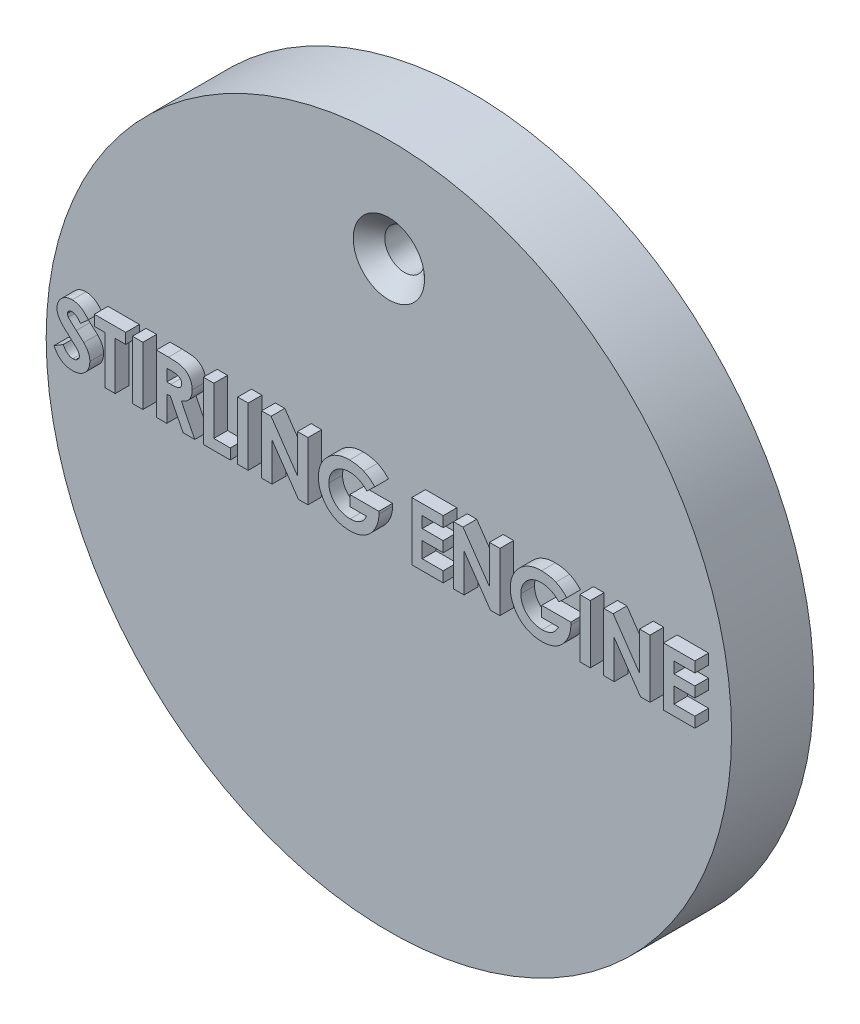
from build123d import *

# Parameters (mm, degrees)
SKETCH1_R                                       = 50
BOSS_EXTRUDE2_DEPTH                             = 12
SKETCH2_W                                       = 1.525641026
SKETCH2_H                                       = 8.5
SKETCH2_W_2                                     = 1.525641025
BOSS_EXTRUDE3_DEPTH                             = 2
CSK_FOR_M5_FLAT_HEAD_MACHINE_SCREW1_D           = 5.8
CSK_FOR_M5_FLAT_HEAD_MACHINE_SCREW1_CSINK_D     = 10.4
CSK_FOR_M5_FLAT_HEAD_MACHINE_SCREW1_CSINK_ANGLE = 90


with BuildPart() as part:
    # Sketch1 → Boss-Extrude2 (new body)
    with BuildSketch(Plane.XY):
        Circle(SKETCH1_R)
    extrude(amount=BOSS_EXTRUDE2_DEPTH)

    # Sketch2 → Boss-Extrude3 (add)
    # profile 1 of 14: a face of its own
    with BuildSketch(Plane.XY.offset(12)):
        with BuildLine():
            Line((-41.846153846, 7.364282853), (-42.986979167, 6.320512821))
            add(Edge.make_bspline(
                [(-42.986979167, 6.320512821), (-43.035847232, 6.389446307), (-43.129667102, 6.521788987), (-43.281739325, 6.698998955), (-43.433124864, 6.850172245), (-43.585226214, 6.974677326), (-43.739391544, 7.071757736), (-43.895353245, 7.140491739), (-44.052227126, 7.184186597), (-44.157622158, 7.189627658), (-44.209535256, 7.192307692)],
                knots=[0, 0, 0, 0, 1.299362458, 2.494594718, 3.587462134, 4.587049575, 5.512617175, 6.380583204, 7.202344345, 8, 8, 8, 8], degree=3))
            add(Edge.make_bspline(
                [(-44.209535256, 7.192307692), (-44.257958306, 7.190609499), (-44.351450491, 7.187330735), (-44.484730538, 7.154740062), (-44.603058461, 7.098493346), (-44.706318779, 7.024946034), (-44.788116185, 6.936338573), (-44.853425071, 6.84341213), (-44.890199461, 6.740842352), (-44.895039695, 6.670393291), (-44.897435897, 6.635516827)],
                knots=[0, 0, 0, 0, 1.185010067, 2.2879431, 3.333075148, 4.379039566, 5.372662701, 6.27520591, 7.14612461, 8, 8, 8, 8], degree=3))
            add(Edge.make_bspline(
                [(-44.897435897, 6.635516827), (-44.895934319, 6.600137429), (-44.892910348, 6.528888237), (-44.863702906, 6.424463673), (-44.81967895, 6.322428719), (-44.777612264, 6.260315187), (-44.756109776, 6.228565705)],
                knots=[0, 0, 0, 0, 0.967525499, 1.948461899, 2.951351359, 4, 4, 4, 4], degree=3))
            add(Edge.make_bspline(
                [(-44.756109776, 6.228565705), (-44.736561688, 6.203887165), (-44.691564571, 6.147080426), (-44.605764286, 6.057107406), (-44.498017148, 5.946882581), (-44.364176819, 5.82019626), (-44.209799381, 5.672492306), (-44.027729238, 5.50957702), (-43.823207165, 5.326405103), (-43.677837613, 5.198850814), (-43.60166266, 5.132011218)],
                knots=[0, 0, 0, 0, 0.473873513, 1.090794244, 1.870441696, 2.795289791, 3.865433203, 5.087734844, 6.473946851, 8, 8, 8, 8], degree=3))
            add(Edge.make_bspline(
                [(-43.60166266, 5.132011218), (-43.530161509, 5.070130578), (-43.394467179, 4.95269398), (-43.201401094, 4.786011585), (-43.03172816, 4.636051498), (-42.88297663, 4.505064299), (-42.757401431, 4.391675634), (-42.654474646, 4.295343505), (-42.572939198, 4.217943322), (-42.526591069, 4.171193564), (-42.506810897, 4.151241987)],
                knots=[0, 0, 0, 0, 1.543621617, 2.929473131, 4.163658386, 5.240097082, 6.164993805, 6.925417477, 7.541396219, 8, 8, 8, 8], degree=3))
            add(Edge.make_bspline(
                [(-42.506810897, 4.151241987), (-42.431769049, 4.070030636), (-42.287512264, 3.913913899), (-42.100029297, 3.671982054), (-41.94572475, 3.435807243), (-41.826351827, 3.200945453), (-41.736196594, 2.964008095), (-41.672635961, 2.719184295), (-41.634569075, 2.463915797), (-41.630342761, 2.28972621), (-41.628205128, 2.201622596)],
                knots=[0, 0, 0, 0, 1.206664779, 2.319633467, 3.337109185, 4.282041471, 5.190008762, 6.099243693, 7.03861361, 8, 8, 8, 8], degree=3))
            add(Edge.make_bspline(
                [(-41.628205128, 2.201622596), (-41.629726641, 2.11577643), (-41.632711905, 1.947343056), (-41.66927567, 1.700865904), (-41.721413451, 1.464976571), (-41.802027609, 1.242241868), (-41.900279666, 1.029005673), (-42.023452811, 0.828589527), (-42.168102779, 0.638965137), (-42.333893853, 0.463522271), (-42.517278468, 0.304320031), (-42.713975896, 0.162594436), (-42.925909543, 0.045581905), (-43.151268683, -0.050769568), (-43.389932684, -0.12498076), (-43.641617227, -0.179829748), (-43.906707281, -0.212749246), (-44.087979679, -0.216190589), (-44.180588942, -0.217948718)],
                knots=[0, 0, 0, 0, 1.043214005, 2.046824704, 3.02475056, 3.976699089, 4.921714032, 5.875962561, 6.831408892, 7.817874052, 8.806269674, 9.781291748, 10.760897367, 11.74438705, 12.757449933, 13.795994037, 14.874007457, 16, 16, 16, 16], degree=3))
            add(Edge.make_bspline(
                [(-44.180588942, -0.217948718), (-44.253286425, -0.216659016), (-44.397269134, -0.214104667), (-44.609477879, -0.193250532), (-44.814389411, -0.159594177), (-45.011772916, -0.111354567), (-45.202517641, -0.050228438), (-45.38663142, 0.024434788), (-45.562843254, 0.113792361), (-45.732486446, 0.216006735), (-45.894736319, 0.334691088), (-46.051644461, 0.467418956), (-46.201652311, 0.616231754), (-46.345480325, 0.780777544), (-46.482208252, 0.961522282), (-46.616311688, 1.155948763), (-46.741830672, 1.367665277), (-46.819369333, 1.516186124), (-46.858974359, 1.592047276)],
                knots=[0, 0, 0, 0, 1.016823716, 2.013894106, 2.979844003, 3.91962641, 4.853723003, 5.779685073, 6.695824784, 7.614987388, 8.547259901, 9.504950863, 10.487499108, 11.500346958, 12.559593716, 13.656357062, 14.802919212, 16, 16, 16, 16], degree=3))
            Line((-46.858974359, 1.592047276), (-45.517227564, 2.397435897))
            add(Edge.make_bspline(
                [(-45.517227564, 2.397435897), (-45.467687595, 2.311323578), (-45.372715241, 2.146238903), (-45.211775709, 1.924426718), (-45.046901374, 1.734481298), (-44.87428049, 1.579759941), (-44.696012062, 1.458193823), (-44.511235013, 1.371314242), (-44.31981952, 1.317535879), (-44.189435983, 1.310968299), (-44.124399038, 1.307692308)],
                knots=[0, 0, 0, 0, 1.283663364, 2.460892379, 3.537111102, 4.529833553, 5.449777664, 6.316464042, 7.160231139, 8, 8, 8, 8], degree=3))
            add(Edge.make_bspline(
                [(-44.124399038, 1.307692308), (-44.058247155, 1.31036766), (-43.929902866, 1.315558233), (-43.746707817, 1.36350199), (-43.57874766, 1.438777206), (-43.43356414, 1.54618456), (-43.31063189, 1.67014897), (-43.219900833, 1.808065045), (-43.162902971, 1.957286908), (-43.156876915, 2.06094623), (-43.153846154, 2.113080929)],
                knots=[0, 0, 0, 0, 1.13588714, 2.203786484, 3.234766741, 4.283437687, 5.291419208, 6.222934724, 7.106237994, 8, 8, 8, 8], degree=3))
            add(Edge.make_bspline(
                [(-43.153846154, 2.113080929), (-43.156644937, 2.161583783), (-43.162330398, 2.260112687), (-43.204207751, 2.406609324), (-43.269674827, 2.553039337), (-43.347126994, 2.673145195), (-43.425944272, 2.773706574), (-43.501311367, 2.860838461), (-43.593088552, 2.957103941), (-43.70104312, 3.06262411), (-43.82374871, 3.178327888), (-43.961308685, 3.304203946), (-44.115298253, 3.439143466), (-44.224138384, 3.531062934), (-44.281049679, 3.579126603)],
                knots=[0, 0, 0, 0, 0.916159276, 1.861089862, 2.860218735, 3.940849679, 4.552606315, 5.27541173, 6.11797699, 7.06649574, 8.129236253, 9.306560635, 10.591630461, 12, 12, 12, 12], degree=3))
            add(Edge.make_bspline(
                [(-44.281049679, 3.579126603), (-44.389240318, 3.670666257), (-44.5968909, 3.846358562), (-44.890327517, 4.105850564), (-45.154740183, 4.348369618), (-45.387845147, 4.576913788), (-45.592612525, 4.787262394), (-45.767655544, 4.981123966), (-45.911051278, 5.159993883), (-46.061944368, 5.371853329), (-46.205322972, 5.630018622), (-46.329242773, 5.940621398), (-46.40963671, 6.251184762), (-46.418643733, 6.459679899), (-46.423076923, 6.562299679)],
                knots=[0, 0, 0, 0, 1.345494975, 2.582412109, 3.71882943, 4.751509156, 5.681369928, 6.505683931, 7.230279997, 7.856715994, 8.973648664, 10.023341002, 11.027102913, 12, 12, 12, 12], degree=3))
            add(Edge.make_bspline(
                [(-46.423076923, 6.562299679), (-46.421233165, 6.63507212), (-46.417600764, 6.778441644), (-46.385199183, 6.989245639), (-46.336773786, 7.192653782), (-46.266446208, 7.387923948), (-46.175169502, 7.574811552), (-46.064317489, 7.754231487), (-45.932168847, 7.924532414), (-45.783246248, 8.085601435), (-45.619171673, 8.23280019), (-45.443837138, 8.362717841), (-45.258235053, 8.472448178), (-45.063500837, 8.563477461), (-44.858427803, 8.633154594), (-44.644526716, 8.682545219), (-44.421490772, 8.711921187), (-44.269786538, 8.715914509), (-44.192508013, 8.717948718)],
                knots=[0, 0, 0, 0, 1.010766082, 1.991317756, 2.957454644, 3.913069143, 4.869106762, 5.843196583, 6.838735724, 7.860187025, 8.887984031, 9.89767229, 10.887916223, 11.879572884, 12.879850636, 13.892031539, 14.926195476, 16, 16, 16, 16], degree=3))
            add(Edge.make_bspline(
                [(-44.192508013, 8.717948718), (-44.092358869, 8.714285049), (-43.892851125, 8.706986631), (-43.59787317, 8.649915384), (-43.309751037, 8.560164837), (-43.077576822, 8.451890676), (-42.892840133, 8.347005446), (-42.751256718, 8.250440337), (-42.607187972, 8.139819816), (-42.45947207, 8.014795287), (-42.310853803, 7.873011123), (-42.157107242, 7.717842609), (-42.000327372, 7.547948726), (-41.898445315, 7.426577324), (-41.846153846, 7.364282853)],
                knots=[0, 0, 0, 0, 1.282922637, 2.555718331, 3.837320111, 5.142675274, 5.830281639, 6.55870424, 7.337177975, 8.157850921, 9.037902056, 9.96903443, 10.957596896, 12, 12, 12, 12], degree=3))
        make_face()
    # profile 2 of 14: a face of its own
    with BuildSketch(Plane.XY.offset(12)):
        Polygon((-40.974358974, 8.5), (-36.397435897, 8.5), (-36.397435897, 6.974358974), (-37.923076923, 6.974358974), (-37.923076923, 0), (-39.448717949, 0), (-39.448717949, 6.974358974), (-40.974358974, 6.974358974), align=None)
    # profile 3 of 14: a face of its own
    with BuildSketch(Plane.XY.offset(12)):
        with Locations((-34.653846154, 4.25)):
            Rectangle(SKETCH2_W, SKETCH2_H)
    # profile 4 of 14: a face of its own
    with BuildSketch(Plane.XY.offset(12)):
        with BuildLine():
            Line((-31.929487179, 8.5), (-30.151842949, 8.5))
            add(Edge.make_bspline(
                [(-30.151842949, 8.5), (-30.034341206, 8.499582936), (-29.808352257, 8.498780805), (-29.482488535, 8.486125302), (-29.183137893, 8.46851413), (-28.909857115, 8.441639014), (-28.662763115, 8.406005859), (-28.441608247, 8.364000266), (-28.246398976, 8.316125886), (-28.07548898, 8.256470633), (-27.92125116, 8.189180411), (-27.777480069, 8.111862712), (-27.641003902, 8.025378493), (-27.512734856, 7.927452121), (-27.391558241, 7.819845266), (-27.277245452, 7.702449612), (-27.171411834, 7.574269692), (-27.074712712, 7.43611544), (-26.986579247, 7.290780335), (-26.908687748, 7.138064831), (-26.845346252, 6.977862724), (-26.78937725, 6.812489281), (-26.749064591, 6.639580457), (-26.721027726, 6.460819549), (-26.700500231, 6.275577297), (-26.699319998, 6.149731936), (-26.698717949, 6.085536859)],
                knots=[0, 0, 0, 0, 1.749336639, 3.364467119, 4.854658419, 6.213483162, 7.451590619, 8.570285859, 9.5643256, 10.440900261, 11.26203566, 12.067320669, 12.869050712, 13.665104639, 14.467235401, 15.27997916, 16.102287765, 16.939272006, 17.78853747, 18.631303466, 19.488103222, 20.351255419, 21.228522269, 22.127379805, 23.044756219, 24, 24, 24, 24], degree=3))
            add(Edge.make_bspline(
                [(-26.698717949, 6.085536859), (-26.700281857, 6.018531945), (-26.703348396, 5.887147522), (-26.719866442, 5.694154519), (-26.750056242, 5.509512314), (-26.795783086, 5.333761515), (-26.848340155, 5.164714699), (-26.918227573, 5.005490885), (-26.997102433, 4.853774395), (-27.090779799, 4.711711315), (-27.193586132, 4.576146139), (-27.313147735, 4.452272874), (-27.441718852, 4.3334338), (-27.586526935, 4.227072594), (-27.741188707, 4.125997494), (-27.908777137, 4.034396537), (-28.088198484, 3.949967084), (-28.214340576, 3.902883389), (-28.278846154, 3.87880609)],
                knots=[0, 0, 0, 0, 1.099860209, 2.156625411, 3.176576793, 4.16617041, 5.135385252, 6.078461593, 7.016046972, 7.938469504, 8.868247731, 9.803980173, 10.76021508, 11.73834243, 12.748633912, 13.790971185, 14.870363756, 16, 16, 16, 16], degree=3))
            Line((-28.278846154, 3.87880609), (-26.317307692, 0))
            Line((-26.317307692, 0), (-28.013221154, 0))
            Line((-28.013221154, 0), (-29.886217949, 3.705128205))
            Line((-29.886217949, 3.705128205), (-30.403846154, 3.705128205))
            Line((-30.403846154, 3.705128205), (-30.403846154, 0))
            Line((-30.403846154, 0), (-31.929487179, 0))
            Line((-31.929487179, 0), (-31.929487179, 8.5))
        make_face()
        with BuildLine():
            Line((-30.403846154, 5.230769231), (-29.809595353, 5.230769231))
            add(Edge.make_bspline(
                [(-29.809595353, 5.230769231), (-29.736943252, 5.231587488), (-29.597830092, 5.233154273), (-29.397767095, 5.240421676), (-29.216062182, 5.257932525), (-29.051935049, 5.280056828), (-28.904559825, 5.305602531), (-28.775251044, 5.342211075), (-28.662016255, 5.381438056), (-28.566197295, 5.430187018), (-28.484331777, 5.485625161), (-28.413646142, 5.54860427), (-28.355178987, 5.621494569), (-28.307057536, 5.702315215), (-28.269624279, 5.791781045), (-28.242300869, 5.888909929), (-28.227031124, 5.994808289), (-28.225274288, 6.067892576), (-28.224358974, 6.105969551)],
                knots=[0, 0, 0, 0, 1.688639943, 3.233382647, 4.650958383, 5.928841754, 7.082724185, 8.122798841, 9.049171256, 9.863274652, 10.613301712, 11.341792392, 12.054588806, 12.776240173, 13.521029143, 14.301969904, 15.115324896, 16, 16, 16, 16], degree=3))
            add(Edge.make_bspline(
                [(-28.224358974, 6.105969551), (-28.226089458, 6.151017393), (-28.229488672, 6.239505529), (-28.263219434, 6.366897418), (-28.316911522, 6.484807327), (-28.390508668, 6.59270251), (-28.483194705, 6.687290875), (-28.589559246, 6.770671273), (-28.711897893, 6.836602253), (-28.825174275, 6.880089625), (-28.928229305, 6.906108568), (-29.021233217, 6.925497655), (-29.128932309, 6.939239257), (-29.251407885, 6.953814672), (-29.388347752, 6.963266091), (-29.540498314, 6.970163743), (-29.707422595, 6.972985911), (-29.823784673, 6.973888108), (-29.884515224, 6.974358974)],
                knots=[0, 0, 0, 0, 1.020303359, 2.004196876, 2.966617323, 3.9489082, 4.950758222, 5.960522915, 7.003732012, 8.091992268, 8.70421221, 9.413913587, 10.24622431, 11.166358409, 12.212345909, 13.359657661, 14.621978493, 16, 16, 16, 16], degree=3))
            Line((-29.884515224, 6.974358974), (-30.403846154, 6.974358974))
            Line((-30.403846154, 6.974358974), (-30.403846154, 5.230769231))
        make_face(mode=Mode.SUBTRACT)
    # profile 5 of 14: a face of its own
    with BuildSketch(Plane.XY.offset(12)):
        Polygon((-25.064102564, 8.5), (-23.538461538, 8.5), (-23.538461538, 1.525641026), (-21.141025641, 1.525641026), (-21.141025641, 0), (-25.064102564, 0), align=None)
    # profile 6 of 14: a face of its own
    with BuildSketch(Plane.XY.offset(12)):
        with Locations((-19.288461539, 4.25)):
            Rectangle(SKETCH2_W_2, SKETCH2_H)
    # profile 7 of 14: a face of its own
    with BuildSketch(Plane.XY.offset(12)):
        Polygon((-16.564102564, 8.5), (-15.190004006, 8.5), (-11.333333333, 2.906550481), (-11.333333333, 8.5), (-9.807692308, 8.5), (-9.807692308, 0), (-11.192007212, 0), (-15.038461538, 5.576422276), (-15.038461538, 0), (-16.564102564, 0), align=None)
    # profile 8 of 14: a face of its own
    with BuildSketch(Plane.XY.offset(12)):
        with BuildLine():
            Line((-0.056189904, 7.148036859), (-1.210637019, 6.04296875))
            add(Edge.make_bspline(
                [(-1.210637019, 6.04296875), (-1.302036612, 6.134477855), (-1.481377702, 6.314033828), (-1.77466762, 6.547738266), (-2.078426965, 6.746433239), (-2.393655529, 6.909814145), (-2.720792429, 7.03654658), (-3.059192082, 7.127202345), (-3.409405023, 7.180971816), (-3.646483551, 7.188499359), (-3.766426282, 7.192307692)],
                knots=[0, 0, 0, 0, 1.075575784, 2.110457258, 3.113929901, 4.09197124, 5.059417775, 6.02750972, 7.002078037, 8, 8, 8, 8], degree=3))
            add(Edge.make_bspline(
                [(-3.766426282, 7.192307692), (-3.870412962, 7.18963921), (-4.074599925, 7.184399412), (-4.374633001, 7.144608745), (-4.661332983, 7.078140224), (-4.936054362, 6.986059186), (-5.197119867, 6.866232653), (-5.446042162, 6.720510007), (-5.681289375, 6.547776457), (-5.901009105, 6.351306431), (-6.101064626, 6.13680083), (-6.27572366, 5.907203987), (-6.424495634, 5.666795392), (-6.54696531, 5.414345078), (-6.640151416, 5.150240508), (-6.706674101, 4.874673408), (-6.748899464, 4.588444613), (-6.753885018, 4.393176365), (-6.756410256, 4.294270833)],
                knots=[0, 0, 0, 0, 1.075001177, 2.110859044, 3.123021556, 4.114053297, 5.101481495, 6.087880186, 7.091499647, 8.114004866, 9.131394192, 10.11971144, 11.092043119, 12.050101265, 13.015322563, 13.981809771, 14.977764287, 16, 16, 16, 16], degree=3))
            add(Edge.make_bspline(
                [(-6.756410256, 4.294270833), (-6.754054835, 4.191942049), (-6.749414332, 3.990340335), (-6.704837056, 3.694481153), (-6.636158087, 3.4098433), (-6.535630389, 3.138538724), (-6.411911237, 2.87685093), (-6.255014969, 2.62984906), (-6.072058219, 2.393761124), (-5.863367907, 2.172697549), (-5.63636674, 1.968930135), (-5.39051709, 1.793155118), (-5.133299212, 1.641499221), (-4.860561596, 1.521392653), (-4.57703816, 1.424960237), (-4.279853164, 1.356967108), (-3.969675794, 1.315253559), (-3.758044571, 1.310237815), (-3.650641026, 1.307692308)],
                knots=[0, 0, 0, 0, 1.022067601, 2.013613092, 2.983553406, 3.943623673, 4.90013463, 5.87121881, 6.861774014, 7.881098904, 8.905697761, 9.905387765, 10.89678721, 11.884561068, 12.87834324, 13.885584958, 14.926927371, 16, 16, 16, 16], degree=3))
            add(Edge.make_bspline(
                [(-3.650641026, 1.307692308), (-3.580778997, 1.308322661), (-3.443624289, 1.309560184), (-3.242441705, 1.329648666), (-3.049757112, 1.358367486), (-2.864824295, 1.396387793), (-2.68951058, 1.450193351), (-2.521388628, 1.513112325), (-2.361443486, 1.58736926), (-2.210542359, 1.675526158), (-2.066439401, 1.774339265), (-1.930483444, 1.887402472), (-1.80028966, 2.01216662), (-1.677379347, 2.150155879), (-1.563832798, 2.302604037), (-1.456012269, 2.466709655), (-1.355152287, 2.644101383), (-1.295556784, 2.769366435), (-1.265124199, 2.833333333)],
                knots=[0, 0, 0, 0, 1.109579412, 2.178351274, 3.208885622, 4.204702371, 5.174744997, 6.119429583, 7.05542196, 7.97267548, 8.893247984, 9.828544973, 10.778894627, 11.756245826, 12.760884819, 13.796418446, 14.874735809, 16, 16, 16, 16], degree=3))
            Line((-1.265124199, 2.833333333), (-3.705128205, 2.833333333))
            Line((-3.705128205, 2.833333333), (-3.705128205, 4.358974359))
            Line((-3.705128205, 4.358974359), (0.532952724, 4.358974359))
            Line((0.532952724, 4.358974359), (0.544871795, 3.996294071))
            add(Edge.make_bspline(
                [(0.544871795, 3.996294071), (0.543340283, 3.90314857), (0.540279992, 3.717023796), (0.512312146, 3.439915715), (0.465983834, 3.166482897), (0.402648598, 2.896999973), (0.323273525, 2.630145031), (0.22204546, 2.368473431), (0.103508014, 2.110210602), (-0.029304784, 1.856453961), (-0.178548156, 1.612967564), (-0.33923056, 1.382418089), (-0.509061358, 1.165204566), (-0.691734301, 0.964353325), (-0.88440487, 0.778177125), (-1.087452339, 0.607392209), (-1.301594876, 0.451854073), (-1.525698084, 0.310248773), (-1.761038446, 0.186140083), (-2.006322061, 0.078181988), (-2.261178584, -0.013504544), (-2.526265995, -0.088667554), (-2.801062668, -0.146661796), (-3.08557449, -0.186428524), (-3.379957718, -0.213450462), (-3.579631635, -0.216431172), (-3.681290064, -0.217948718)],
                knots=[0, 0, 0, 0, 1.006889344, 2.011981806, 3.007738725, 4.003571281, 5.003404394, 6.015442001, 7.03424805, 8.074616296, 9.110249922, 10.119753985, 11.111721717, 12.089233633, 13.052717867, 14.006597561, 14.955430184, 15.912305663, 16.870361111, 17.829300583, 18.807640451, 19.796414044, 20.806216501, 21.841577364, 22.90109906, 24, 24, 24, 24], degree=3))
            add(Edge.make_bspline(
                [(-3.681290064, -0.217948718), (-3.789752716, -0.216450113), (-4.004758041, -0.213479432), (-4.322672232, -0.18565698), (-4.631363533, -0.139737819), (-4.930908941, -0.076187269), (-5.222003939, 0.002906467), (-5.504148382, 0.102187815), (-5.776765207, 0.220286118), (-6.040670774, 0.354074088), (-6.292492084, 0.505801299), (-6.531664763, 0.672807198), (-6.756883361, 0.856166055), (-6.970454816, 1.052808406), (-7.167389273, 1.267567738), (-7.355025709, 1.493482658), (-7.52427378, 1.738838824), (-7.682410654, 1.995681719), (-7.822900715, 2.26390371), (-7.945761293, 2.538543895), (-8.050536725, 2.818012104), (-8.133154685, 3.103609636), (-8.200232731, 3.393345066), (-8.248228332, 3.688478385), (-8.275333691, 3.98897265), (-8.279802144, 4.190920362), (-8.282051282, 4.292568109)],
                knots=[0, 0, 0, 0, 1.084149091, 2.14910686, 3.187506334, 4.202448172, 5.208724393, 6.201130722, 7.189831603, 8.176984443, 9.156919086, 10.126598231, 11.090766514, 12.05840148, 13.026036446, 14.001772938, 14.991905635, 16.003017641, 17.015720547, 18.016462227, 19.009322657, 19.99686681, 20.986544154, 21.980959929, 22.983742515, 24, 24, 24, 24], degree=3))
            add(Edge.make_bspline(
                [(-8.282051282, 4.292568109), (-8.279039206, 4.431237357), (-8.27309125, 4.70506801), (-8.218004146, 5.108422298), (-8.132131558, 5.498627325), (-8.008895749, 5.874261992), (-7.850755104, 6.235843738), (-7.659949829, 6.584221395), (-7.43233522, 6.919024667), (-7.25614588, 7.126314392), (-7.166766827, 7.231470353)],
                knots=[0, 0, 0, 0, 1.034044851, 2.041932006, 3.031217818, 4.011390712, 4.986069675, 5.97149666, 6.970960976, 8, 8, 8, 8], degree=3))
            add(Edge.make_bspline(
                [(-7.166766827, 7.231470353), (-7.111272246, 7.292306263), (-7.001116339, 7.41306463), (-6.82503232, 7.580860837), (-6.644482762, 7.73859548), (-6.456967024, 7.882923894), (-6.263470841, 8.017005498), (-6.063437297, 8.138326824), (-5.857915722, 8.250750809), (-5.645303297, 8.348536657), (-5.426713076, 8.436209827), (-5.201176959, 8.510393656), (-4.970384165, 8.576102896), (-4.732291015, 8.626090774), (-4.489302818, 8.667716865), (-4.239694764, 8.695616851), (-3.984147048, 8.716065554), (-3.811307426, 8.717316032), (-3.723858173, 8.717948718)],
                knots=[0, 0, 0, 0, 1.020590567, 2.025856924, 3.013483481, 3.991664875, 4.957826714, 5.930500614, 6.890802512, 7.860442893, 8.829981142, 9.809047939, 10.802672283, 11.803273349, 12.823572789, 13.857849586, 14.916166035, 16, 16, 16, 16], degree=3))
            add(Edge.make_bspline(
                [(-3.723858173, 8.717948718), (-3.632445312, 8.716538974), (-3.450567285, 8.713734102), (-3.180144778, 8.694326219), (-2.913479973, 8.664384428), (-2.651696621, 8.619470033), (-2.393916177, 8.564081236), (-2.141472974, 8.493114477), (-1.892720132, 8.412483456), (-1.730782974, 8.348198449), (-1.649939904, 8.316105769)],
                knots=[0, 0, 0, 0, 1.03180557, 2.052914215, 3.058998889, 4.059601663, 5.049854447, 6.033765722, 7.018406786, 8, 8, 8, 8], degree=3))
            add(Edge.make_bspline(
                [(-1.649939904, 8.316105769), (-1.581920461, 8.286446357), (-1.443570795, 8.226119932), (-1.242289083, 8.115749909), (-1.040515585, 7.993392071), (-0.840427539, 7.854572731), (-0.642329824, 7.699551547), (-0.444154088, 7.530777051), (-0.24792338, 7.346281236), (-0.120928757, 7.21497412), (-0.056189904, 7.148036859)],
                knots=[0, 0, 0, 0, 0.894392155, 1.819168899, 2.76525314, 3.739198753, 4.75366411, 5.797420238, 6.877176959, 8, 8, 8, 8], degree=3))
        make_face()
    # profile 9 of 14: a face of its own
    with BuildSketch(Plane.XY.offset(12)):
        Polygon((5.33974359, 8.5), (9.916666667, 8.5), (9.916666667, 6.974358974), (6.865384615, 6.974358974), (6.865384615, 5.33974359), (9.916666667, 5.33974359), (9.916666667, 3.814102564), (6.865384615, 3.814102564), (6.865384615, 1.525641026), (9.916666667, 1.525641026), (9.916666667, 0), (5.33974359, 0), align=None)
    # profile 10 of 14: a face of its own
    with BuildSketch(Plane.XY.offset(12)):
        Polygon((11.442307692, 8.5), (12.81640625, 8.5), (16.673076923, 2.906550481), (16.673076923, 8.5), (18.198717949, 8.5), (18.198717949, 0), (16.814403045, 0), (12.967948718, 5.576422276), (12.967948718, 0), (11.442307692, 0), align=None)
    # profile 11 of 14: a face of its own
    with BuildSketch(Plane.XY.offset(12)):
        with BuildLine():
            Line((27.950220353, 7.148036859), (26.795773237, 6.04296875))
            add(Edge.make_bspline(
                [(26.795773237, 6.04296875), (26.704373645, 6.134477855), (26.525032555, 6.314033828), (26.231742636, 6.547738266), (25.927983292, 6.746433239), (25.612754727, 6.909814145), (25.285617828, 7.03654658), (24.947218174, 7.127202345), (24.597005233, 7.180971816), (24.359926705, 7.188499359), (24.239983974, 7.192307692)],
                knots=[0, 0, 0, 0, 1.075575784, 2.110457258, 3.113929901, 4.09197124, 5.059417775, 6.02750972, 7.002078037, 8, 8, 8, 8], degree=3))
            add(Edge.make_bspline(
                [(24.239983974, 7.192307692), (24.135997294, 7.18963921), (23.931810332, 7.184399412), (23.631777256, 7.144608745), (23.345077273, 7.078140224), (23.070355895, 6.986059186), (22.809290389, 6.866232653), (22.560368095, 6.720510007), (22.325120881, 6.547776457), (22.105401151, 6.351306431), (21.90534563, 6.13680083), (21.730686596, 5.907203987), (21.581914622, 5.666795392), (21.459444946, 5.414345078), (21.366258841, 5.150240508), (21.299736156, 4.874673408), (21.257510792, 4.588444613), (21.252525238, 4.393176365), (21.25, 4.294270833)],
                knots=[0, 0, 0, 0, 1.075001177, 2.110859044, 3.123021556, 4.114053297, 5.101481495, 6.087880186, 7.091499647, 8.114004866, 9.131394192, 10.11971144, 11.092043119, 12.050101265, 13.015322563, 13.981809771, 14.977764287, 16, 16, 16, 16], degree=3))
            add(Edge.make_bspline(
                [(21.25, 4.294270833), (21.252355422, 4.191942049), (21.256995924, 3.990340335), (21.301573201, 3.694481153), (21.370252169, 3.4098433), (21.470779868, 3.138538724), (21.594499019, 2.87685093), (21.751395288, 2.62984906), (21.934352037, 2.393761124), (22.14304235, 2.172697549), (22.370043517, 1.968930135), (22.615893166, 1.793155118), (22.873111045, 1.641499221), (23.145848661, 1.521392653), (23.429372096, 1.424960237), (23.726557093, 1.356967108), (24.036734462, 1.315253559), (24.248365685, 1.310237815), (24.355769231, 1.307692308)],
                knots=[0, 0, 0, 0, 1.022067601, 2.013613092, 2.983553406, 3.943623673, 4.90013463, 5.87121881, 6.861774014, 7.881098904, 8.905697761, 9.905387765, 10.89678721, 11.884561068, 12.87834324, 13.885584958, 14.926927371, 16, 16, 16, 16], degree=3))
            add(Edge.make_bspline(
                [(24.355769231, 1.307692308), (24.42563126, 1.308322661), (24.562785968, 1.309560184), (24.763968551, 1.329648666), (24.956653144, 1.358367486), (25.141585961, 1.396387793), (25.316899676, 1.450193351), (25.485021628, 1.513112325), (25.644966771, 1.58736926), (25.795867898, 1.675526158), (25.939970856, 1.774339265), (26.075926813, 1.887402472), (26.206120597, 2.01216662), (26.32903091, 2.150155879), (26.442577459, 2.302604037), (26.550397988, 2.466709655), (26.65125797, 2.644101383), (26.710853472, 2.769366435), (26.741286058, 2.833333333)],
                knots=[0, 0, 0, 0, 1.109579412, 2.178351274, 3.208885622, 4.204702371, 5.174744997, 6.119429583, 7.05542196, 7.97267548, 8.893247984, 9.828544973, 10.778894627, 11.756245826, 12.760884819, 13.796418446, 14.874735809, 16, 16, 16, 16], degree=3))
            Line((26.741286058, 2.833333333), (24.301282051, 2.833333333))
            Line((24.301282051, 2.833333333), (24.301282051, 4.358974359))
            Line((24.301282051, 4.358974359), (28.539362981, 4.358974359))
            Line((28.539362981, 4.358974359), (28.551282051, 3.996294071))
            add(Edge.make_bspline(
                [(28.551282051, 3.996294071), (28.549750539, 3.90314857), (28.546690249, 3.717023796), (28.518722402, 3.439915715), (28.472394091, 3.166482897), (28.409058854, 2.896999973), (28.329683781, 2.630145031), (28.228455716, 2.368473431), (28.10991827, 2.110210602), (27.977105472, 1.856453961), (27.827862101, 1.612967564), (27.667179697, 1.382418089), (27.497348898, 1.165204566), (27.314675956, 0.964353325), (27.122005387, 0.778177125), (26.918957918, 0.607392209), (26.70481538, 0.451854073), (26.480712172, 0.310248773), (26.24537181, 0.186140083), (26.000088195, 0.078181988), (25.745231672, -0.013504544), (25.480144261, -0.088667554), (25.205347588, -0.146661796), (24.920835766, -0.186428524), (24.626452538, -0.213450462), (24.426778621, -0.216431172), (24.325120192, -0.217948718)],
                knots=[0, 0, 0, 0, 1.006889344, 2.011981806, 3.007738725, 4.003571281, 5.003404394, 6.015442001, 7.03424805, 8.074616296, 9.110249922, 10.119753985, 11.111721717, 12.089233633, 13.052717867, 14.006597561, 14.955430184, 15.912305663, 16.870361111, 17.829300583, 18.807640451, 19.796414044, 20.806216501, 21.841577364, 22.90109906, 24, 24, 24, 24], degree=3))
            add(Edge.make_bspline(
                [(24.325120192, -0.217948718), (24.216657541, -0.216450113), (24.001652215, -0.213479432), (23.683738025, -0.18565698), (23.375046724, -0.139737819), (23.075501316, -0.076187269), (22.784406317, 0.002906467), (22.502261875, 0.102187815), (22.229645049, 0.220286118), (21.965739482, 0.354074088), (21.713918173, 0.505801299), (21.474745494, 0.672807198), (21.249526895, 0.856166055), (21.03595544, 1.052808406), (20.839020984, 1.267567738), (20.651384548, 1.493482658), (20.482136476, 1.738838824), (20.323999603, 1.995681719), (20.183509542, 2.26390371), (20.060648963, 2.538543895), (19.955873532, 2.818012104), (19.873255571, 3.103609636), (19.806177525, 3.393345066), (19.758181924, 3.688478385), (19.731076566, 3.98897265), (19.726608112, 4.190920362), (19.724358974, 4.292568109)],
                knots=[0, 0, 0, 0, 1.084149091, 2.14910686, 3.187506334, 4.202448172, 5.208724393, 6.201130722, 7.189831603, 8.176984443, 9.156919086, 10.126598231, 11.090766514, 12.05840148, 13.026036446, 14.001772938, 14.991905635, 16.003017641, 17.015720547, 18.016462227, 19.009322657, 19.99686681, 20.986544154, 21.980959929, 22.983742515, 24, 24, 24, 24], degree=3))
            add(Edge.make_bspline(
                [(19.724358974, 4.292568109), (19.72737105, 4.431237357), (19.733319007, 4.70506801), (19.78840611, 5.108422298), (19.874278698, 5.498627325), (19.997514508, 5.874261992), (20.155655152, 6.235843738), (20.346460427, 6.584221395), (20.574075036, 6.919024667), (20.750264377, 7.126314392), (20.839643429, 7.231470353)],
                knots=[0, 0, 0, 0, 1.034044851, 2.041932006, 3.031217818, 4.011390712, 4.986069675, 5.97149666, 6.970960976, 8, 8, 8, 8], degree=3))
            add(Edge.make_bspline(
                [(20.839643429, 7.231470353), (20.89513801, 7.292306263), (21.005293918, 7.41306463), (21.181377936, 7.580860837), (21.361927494, 7.73859548), (21.549443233, 7.882923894), (21.742939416, 8.017005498), (21.94297296, 8.138326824), (22.148494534, 8.250750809), (22.36110696, 8.348536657), (22.57969718, 8.436209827), (22.805233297, 8.510393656), (23.036026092, 8.576102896), (23.274119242, 8.626090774), (23.517107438, 8.667716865), (23.766715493, 8.695616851), (24.022263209, 8.716065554), (24.195102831, 8.717316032), (24.282552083, 8.717948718)],
                knots=[0, 0, 0, 0, 1.020590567, 2.025856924, 3.013483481, 3.991664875, 4.957826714, 5.930500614, 6.890802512, 7.860442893, 8.829981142, 9.809047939, 10.802672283, 11.803273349, 12.823572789, 13.857849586, 14.916166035, 16, 16, 16, 16], degree=3))
            add(Edge.make_bspline(
                [(24.282552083, 8.717948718), (24.373964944, 8.716538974), (24.555842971, 8.713734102), (24.826265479, 8.694326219), (25.092930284, 8.664384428), (25.354713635, 8.619470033), (25.612494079, 8.564081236), (25.864937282, 8.493114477), (26.113690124, 8.412483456), (26.275627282, 8.348198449), (26.356470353, 8.316105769)],
                knots=[0, 0, 0, 0, 1.03180557, 2.052914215, 3.058998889, 4.059601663, 5.049854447, 6.033765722, 7.018406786, 8, 8, 8, 8], degree=3))
            add(Edge.make_bspline(
                [(26.356470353, 8.316105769), (26.424489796, 8.286446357), (26.562839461, 8.226119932), (26.764121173, 8.115749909), (26.965894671, 7.993392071), (27.165982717, 7.854572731), (27.364080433, 7.699551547), (27.562256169, 7.530777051), (27.758486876, 7.346281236), (27.885481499, 7.21497412), (27.950220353, 7.148036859)],
                knots=[0, 0, 0, 0, 0.894392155, 1.819168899, 2.76525314, 3.739198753, 4.75366411, 5.797420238, 6.877176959, 8, 8, 8, 8], degree=3))
        make_face()
    # profile 12 of 14: a face of its own
    with BuildSketch(Plane.XY.offset(12)):
        with Locations((30.621794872, 4.25)):
            Rectangle(SKETCH2_W, SKETCH2_H)
    # profile 13 of 14: a face of its own
    with BuildSketch(Plane.XY.offset(12)):
        Polygon((33.346153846, 8.5), (34.720252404, 8.5), (38.576923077, 2.906550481), (38.576923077, 8.5), (40.102564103, 8.5), (40.102564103, 0), (38.718249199, 0), (34.871794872, 5.576422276), (34.871794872, 0), (33.346153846, 0), align=None)
    # profile 14 of 14: a face of its own
    with BuildSketch(Plane.XY.offset(12)):
        Polygon((42.064102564, 8.5), (46.641025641, 8.5), (46.641025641, 6.974358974), (43.58974359, 6.974358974), (43.58974359, 5.33974359), (46.641025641, 5.33974359), (46.641025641, 3.814102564), (43.58974359, 3.814102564), (43.58974359, 1.525641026), (46.641025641, 1.525641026), (46.641025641, 0), (42.064102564, 0), align=None)
    extrude(amount=BOSS_EXTRUDE3_DEPTH)

    # CSK for M5 Flat Head Machine Screw1 (through all)
    with Locations(Plane.XY.offset(12)):
        with Locations((0, 35)):
            CounterSinkHole(CSK_FOR_M5_FLAT_HEAD_MACHINE_SCREW1_D / 2, CSK_FOR_M5_FLAT_HEAD_MACHINE_SCREW1_CSINK_D / 2, counter_sink_angle=CSK_FOR_M5_FLAT_HEAD_MACHINE_SCREW1_CSINK_ANGLE)


solid = part.part
